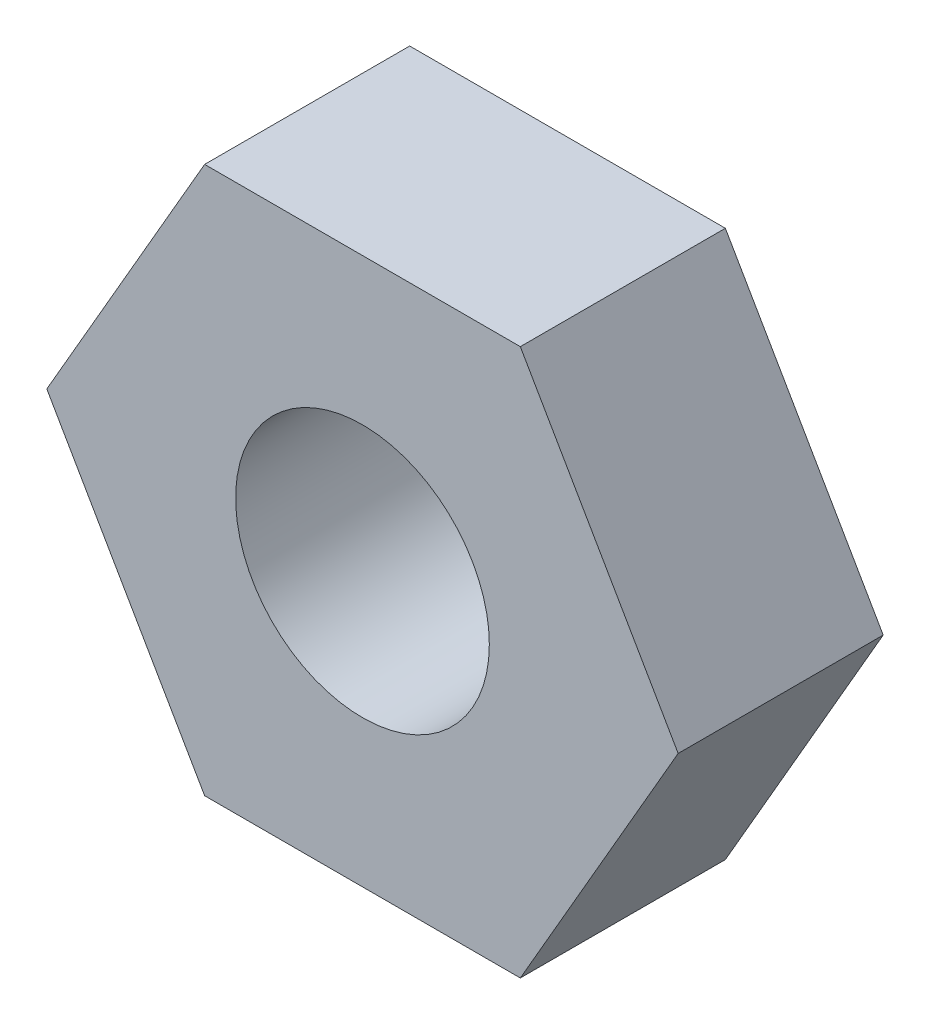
from build123d import *

# Parameters (mm, degrees)
BOSS_EXTRUDE1_DEPTH   = 2.38125
F_4_CLEARANCE_HOLE1_D = 2.9464


with BuildPart() as part:
    # Sketch1 → Boss-Extrude1 (new body)
    with BuildSketch(Plane.XY):
        Polygon((1.833087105, 3.175), (-1.833087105, 3.175), (-3.666174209, 0), (-1.833087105, -3.175), (1.833087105, -3.175), (3.666174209, 0), align=None)
    extrude(amount=BOSS_EXTRUDE1_DEPTH)

    # 4 Clearance Hole1 (through all)
    with Locations(Plane.XY.offset(2.38125)):
        with Locations((0, 0)):
            Hole(F_4_CLEARANCE_HOLE1_D / 2)


solid = part.part
